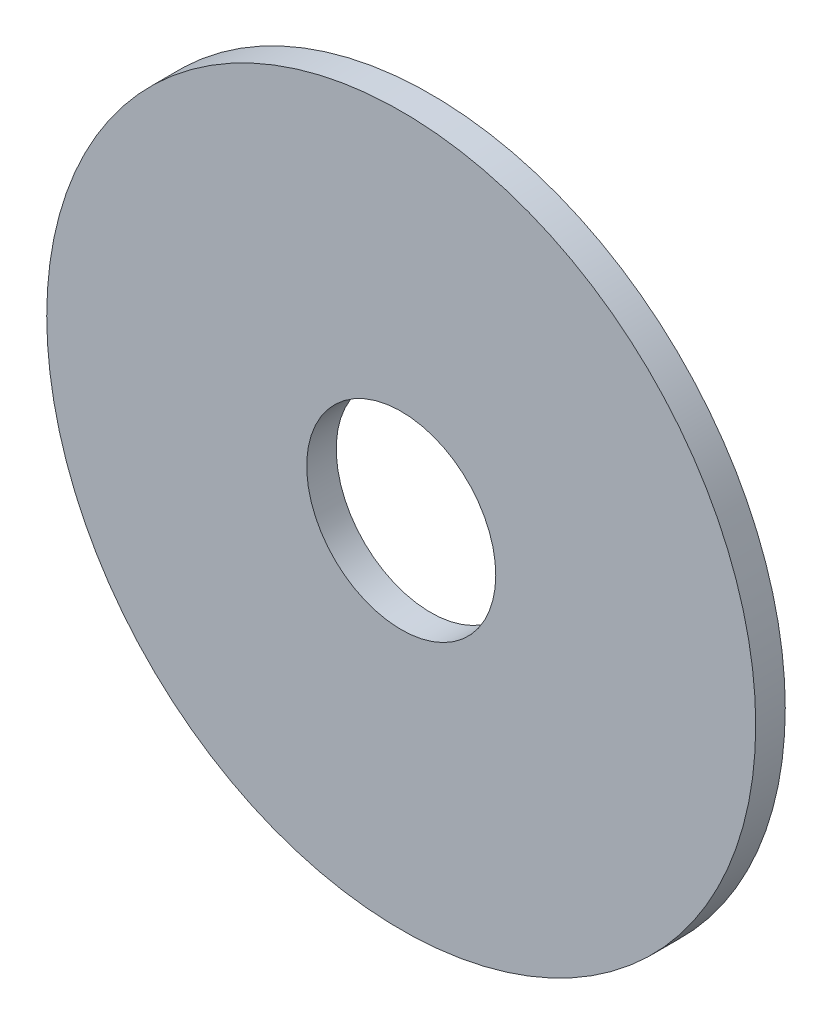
from build123d import *

# Parameters (mm, degrees)
ESQUISSE1_R      = 6
ESQUISSE1_R_2    = 1.6
EXTRUSION1_DEPTH = 0.5


with BuildPart() as part:
    # Esquisse1 → Extrusion1 (new body)
    with BuildSketch(Plane.XY):
        Circle(ESQUISSE1_R)
        Circle(ESQUISSE1_R_2, mode=Mode.SUBTRACT)
    extrude(amount=EXTRUSION1_DEPTH)


solid = part.part
